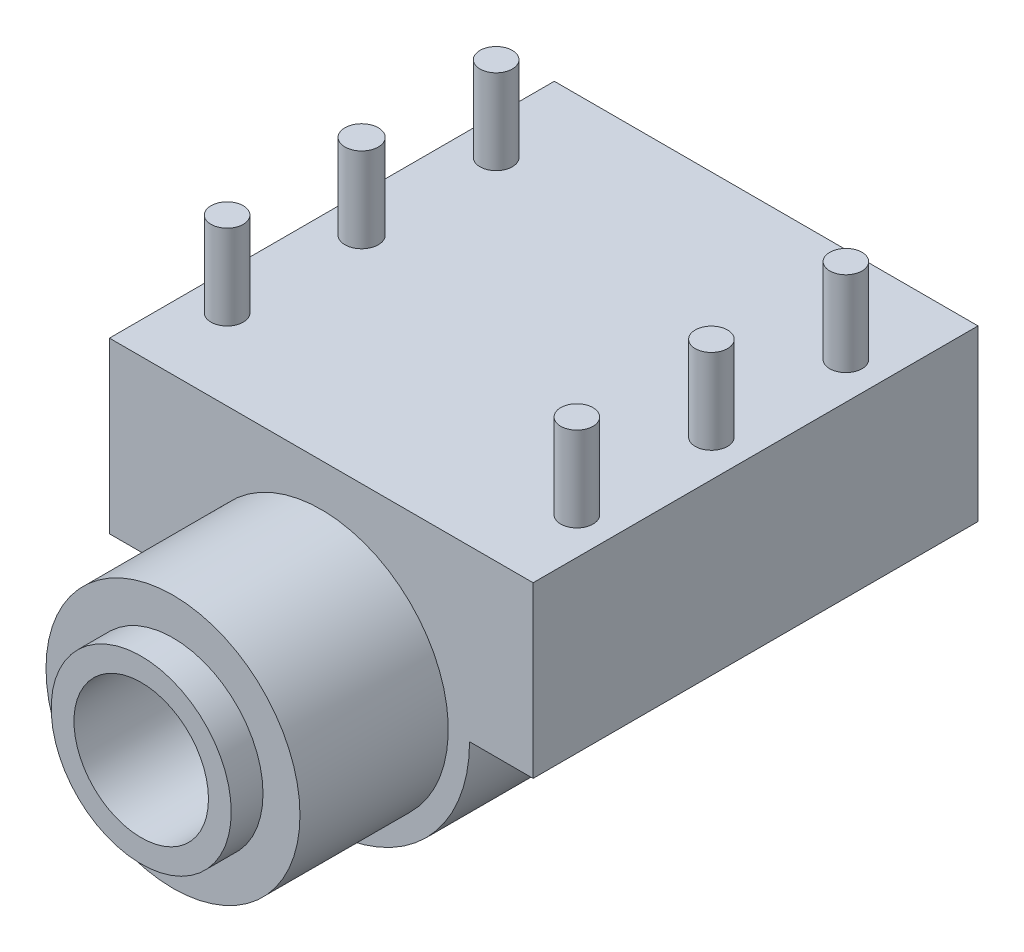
from build123d import *

# Parameters (mm, degrees)
SKETCH_1_R          = 5.9944
EXTRUDE_1_DEPTH     = 7
SKETCH_2_R          = 7
EXTRUDE_2_DEPTH     = 21
SKETCH_3_W          = 20
SKETCH_3_H          = 8
EXTRUDE_4_DEPTH     = 21
SKETCH_5_R          = 0.762
SKETCH_5_R_2        = 0.7874
EXTRUDE_5_DEPTH     = 4
SKETCH1_R           = 4.5
BOSS_EXTRUDE1_DEPTH = 3
CHAMFER1_SIZE       = 0.3
CHAMFER1_SIZE2      = 3.429015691
SKETCH2_R           = 4.25
BOSS_EXTRUDE2_DEPTH = 1.5
SKETCH3_R           = 3.175
CUT_EXTRUDE1_DEPTH  = 32


with BuildPart() as part:
    # Sketch 1 → Extrude 1 (new body)
    with BuildSketch(Plane.XY):
        Circle(SKETCH_1_R)
    extrude(amount=EXTRUDE_1_DEPTH)

    # Sketch 2 → Extrude 2 (add)
    with BuildSketch(Plane(origin=(0, 0, 0), x_dir=(-1, 0, 0), z_dir=(0, 0, -1))):
        with Locations(Location((0, 0, 0), (0, 0, 180))):
            Circle(SKETCH_2_R)
    extrude(amount=EXTRUDE_2_DEPTH)

    # Sketch 3 → Extrude 4 (add)
    with BuildSketch(Plane.XY):
        with Locations((0, 4)):
            Rectangle(SKETCH_3_W, SKETCH_3_H)
    extrude(amount=-EXTRUDE_4_DEPTH)

    # Sketch 5 → Extrude 5 (add)
    with BuildSketch(Plane(origin=(0, 8, 0), x_dir=(1, 0, 0), z_dir=(0, 1, 0))):
        with Locations(Location((-8.255, 16.51, 0), (0, 0, 270))):
            Circle(SKETCH_5_R)
        with Locations(Location((8.255, 16.51, 0), (0, 0, 270))):
            Circle(SKETCH_5_R)
        with Locations(Location((-8.255, 10.16, 0), (0, 0, 270))):
            Circle(SKETCH_5_R_2)
        with Locations(Location((8.255, 10.16, 0), (0, 0, 270))):
            Circle(SKETCH_5_R)
        with Locations(Location((-8.255, 3.81, 0), (0, 0, 270))):
            Circle(SKETCH_5_R)
        with Locations(Location((8.255, 3.81, 0), (0, 0, 270))):
            Circle(SKETCH_5_R)
    extrude(amount=EXTRUDE_5_DEPTH)

    # Sketch1 → Boss-Extrude1 (add)
    with BuildSketch(Plane(origin=(0, 0, -21), x_dir=(-1, 0, 0), z_dir=(0, 0, -1))):
        Circle(SKETCH1_R)
    extrude(amount=BOSS_EXTRUDE1_DEPTH)

    # Chamfer1
    chamfer1_edges = [part.edges().sort_by_distance(p)[0] for p in [
        (4.5, 0, -24),
    ]]
    chamfer1_side = [part.faces().sort_by_distance(p)[0] for p in [
        (4.5, 0, -22.5),
    ]]
    chamfer(chamfer1_edges, length=CHAMFER1_SIZE, length2=CHAMFER1_SIZE2, reference=chamfer1_side[0])

    # Sketch2 → Boss-Extrude2 (add)
    with BuildSketch(Plane.XY.offset(7)):
        Circle(SKETCH2_R)
    extrude(amount=BOSS_EXTRUDE2_DEPTH)

    # Sketch3 → Cut-Extrude1 (cut)
    with BuildSketch(Plane.XY.offset(8.5)):
        Circle(SKETCH3_R)
    extrude(amount=-CUT_EXTRUDE1_DEPTH, mode=Mode.SUBTRACT)


solid = part.part
